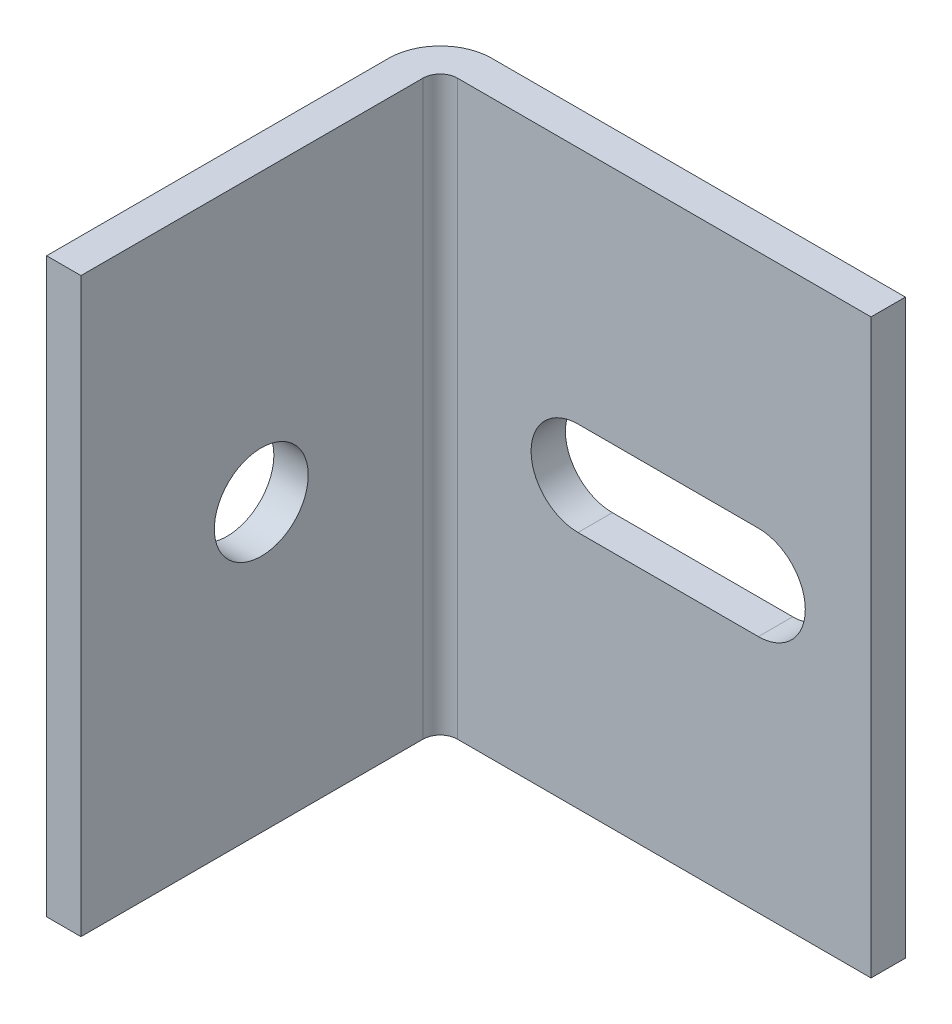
ISO-10303-21;
HEADER;
FILE_DESCRIPTION(('STEP AP214'),'2;1');
FILE_NAME('part.step','',(''),(''),'','','');
FILE_SCHEMA(('AUTOMOTIVE_DESIGN { 1 0 10303 214 1 1 1 1 }'));
ENDSEC;
DATA;
#1=APPLICATION_CONTEXT('core data for automotive mechanical design processes');
#2=APPLICATION_PROTOCOL_DEFINITION('international standard','automotive_design',2000,#1);
#3=PRODUCT_CONTEXT('',#1,'mechanical');
#4=PRODUCT('Part','Part','',(#3));
#5=PRODUCT_RELATED_PRODUCT_CATEGORY('part','',(#4));
#6=PRODUCT_DEFINITION_FORMATION('','',#4);
#7=PRODUCT_DEFINITION_CONTEXT('part definition',#1,'design');
#8=PRODUCT_DEFINITION('design','',#6,#7);
#9=PRODUCT_DEFINITION_SHAPE('','',#8);
#10=(LENGTH_UNIT() NAMED_UNIT(*) SI_UNIT(.MILLI.,.METRE.));
#11=(NAMED_UNIT(*) PLANE_ANGLE_UNIT() SI_UNIT($,.RADIAN.));
#12=(NAMED_UNIT(*) SI_UNIT($,.STERADIAN.) SOLID_ANGLE_UNIT());
#13=UNCERTAINTY_MEASURE_WITH_UNIT(LENGTH_MEASURE(1.E-05),#10,'distance_accuracy_value','');
#14=(GEOMETRIC_REPRESENTATION_CONTEXT(3) GLOBAL_UNCERTAINTY_ASSIGNED_CONTEXT((#13)) GLOBAL_UNIT_ASSIGNED_CONTEXT((#10,
#11,#12)) REPRESENTATION_CONTEXT('',''));
#15=CARTESIAN_POINT('',(0.,0.,0.));
#16=DIRECTION('',(0.,0.,1.));
#17=DIRECTION('',(1.,0.,0.));
#18=AXIS2_PLACEMENT_3D('',#15,#16,#17);
#19=CARTESIAN_POINT('',(2.286,12.7,1.524));
#20=DIRECTION('',(0.,0.,-1.));
#21=DIRECTION('',(-1.,0.,0.));
#22=AXIS2_PLACEMENT_3D('',#19,#20,#21);
#23=PLANE('',#22);
#24=DIRECTION('',(1.,0.,0.));
#25=VECTOR('',#24,1.);
#26=CARTESIAN_POINT('',(2.286,-12.7,1.524));
#27=LINE('',#26,#25);
#28=CARTESIAN_POINT('',(2.286,-12.7,1.524));
#29=VERTEX_POINT('',#28);
#30=CARTESIAN_POINT('',(20.6375,-12.7,1.524));
#31=VERTEX_POINT('',#30);
#32=EDGE_CURVE('E160',#29,#31,#27,.T.);
#33=ORIENTED_EDGE('',*,*,#32,.T.);
#34=DIRECTION('',(0.,-1.,0.));
#35=VECTOR('',#34,1.);
#36=CARTESIAN_POINT('',(20.6375,12.7,1.524));
#37=LINE('',#36,#35);
#38=CARTESIAN_POINT('',(20.6375,12.7,1.524));
#39=VERTEX_POINT('',#38);
#40=EDGE_CURVE('E11',#39,#31,#37,.T.);
#41=ORIENTED_EDGE('',*,*,#40,.F.);
#42=DIRECTION('',(1.,0.,0.));
#43=VECTOR('',#42,1.);
#44=CARTESIAN_POINT('',(2.286,12.7,1.524));
#45=LINE('',#44,#43);
#46=CARTESIAN_POINT('',(2.286,12.7,1.524));
#47=VERTEX_POINT('',#46);
#48=EDGE_CURVE('E163',#47,#39,#45,.T.);
#49=ORIENTED_EDGE('',*,*,#48,.F.);
#50=DIRECTION('',(0.,-1.,0.));
#51=VECTOR('',#50,1.);
#52=CARTESIAN_POINT('',(2.286,12.7,1.524));
#53=LINE('',#52,#51);
#54=EDGE_CURVE('E185',#47,#29,#53,.T.);
#55=ORIENTED_EDGE('',*,*,#54,.T.);
#56=EDGE_LOOP('',(#33,#41,#49,#55));
#57=FACE_BOUND('',#56,.T.);
#58=CARTESIAN_POINT('',(7.63749999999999,0.,1.524));
#59=DIRECTION('',(0.,0.,-1.));
#60=DIRECTION('',(-1.,0.,0.));
#61=AXIS2_PLACEMENT_3D('',#58,#59,#60);
#62=CIRCLE('',#61,2.0828);
#63=CARTESIAN_POINT('',(7.63749999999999,2.0828,1.524));
#64=VERTEX_POINT('',#63);
#65=CARTESIAN_POINT('',(7.63749999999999,-2.0828,1.524));
#66=VERTEX_POINT('',#65);
#67=EDGE_CURVE('E124',#64,#66,#62,.F.);
#68=ORIENTED_EDGE('',*,*,#67,.F.);
#69=DIRECTION('',(-1.,0.,0.));
#70=VECTOR('',#69,1.);
#71=CARTESIAN_POINT('',(2.286,2.0828,1.524));
#72=LINE('',#71,#70);
#73=CARTESIAN_POINT('',(15.6375,2.0828,1.524));
#74=VERTEX_POINT('',#73);
#75=EDGE_CURVE('E127',#74,#64,#72,.T.);
#76=ORIENTED_EDGE('',*,*,#75,.F.);
#77=CARTESIAN_POINT('',(15.6375,0.,1.524));
#78=DIRECTION('',(0.,0.,-1.));
#79=DIRECTION('',(-1.,0.,0.));
#80=AXIS2_PLACEMENT_3D('',#77,#78,#79);
#81=CIRCLE('',#80,2.0828);
#82=CARTESIAN_POINT('',(15.6375,-2.0828,1.524));
#83=VERTEX_POINT('',#82);
#84=EDGE_CURVE('E151',#83,#74,#81,.F.);
#85=ORIENTED_EDGE('',*,*,#84,.F.);
#86=DIRECTION('',(1.,0.,0.));
#87=VECTOR('',#86,1.);
#88=CARTESIAN_POINT('',(2.286,-2.0828,1.524));
#89=LINE('',#88,#87);
#90=EDGE_CURVE('E153',#66,#83,#89,.T.);
#91=ORIENTED_EDGE('',*,*,#90,.F.);
#92=EDGE_LOOP('',(#68,#76,#85,#91));
#93=FACE_BOUND('',#92,.T.);
#94=ADVANCED_FACE('F34',(#57,#93),#23,.F.);
#95=CARTESIAN_POINT('',(2.286,12.7,0.));
#96=DIRECTION('',(0.,0.,-1.));
#97=DIRECTION('',(-1.,0.,0.));
#98=AXIS2_PLACEMENT_3D('',#95,#96,#97);
#99=PLANE('',#98);
#100=DIRECTION('',(1.,0.,0.));
#101=VECTOR('',#100,1.);
#102=CARTESIAN_POINT('',(2.286,-12.7,0.));
#103=LINE('',#102,#101);
#104=CARTESIAN_POINT('',(2.286,-12.7,0.));
#105=VERTEX_POINT('',#104);
#106=CARTESIAN_POINT('',(20.6375,-12.7,0.));
#107=VERTEX_POINT('',#106);
#108=EDGE_CURVE('E191',#105,#107,#103,.T.);
#109=ORIENTED_EDGE('',*,*,#108,.F.);
#110=DIRECTION('',(0.,-1.,0.));
#111=VECTOR('',#110,1.);
#112=CARTESIAN_POINT('',(2.286,12.7,0.));
#113=LINE('',#112,#111);
#114=CARTESIAN_POINT('',(2.286,12.7,0.));
#115=VERTEX_POINT('',#114);
#116=EDGE_CURVE('E217',#115,#105,#113,.T.);
#117=ORIENTED_EDGE('',*,*,#116,.F.);
#118=DIRECTION('',(1.,0.,0.));
#119=VECTOR('',#118,1.);
#120=CARTESIAN_POINT('',(2.286,12.7,0.));
#121=LINE('',#120,#119);
#122=CARTESIAN_POINT('',(20.6375,12.7,0.));
#123=VERTEX_POINT('',#122);
#124=EDGE_CURVE('E169',#115,#123,#121,.T.);
#125=ORIENTED_EDGE('',*,*,#124,.T.);
#126=DIRECTION('',(0.,-1.,0.));
#127=VECTOR('',#126,1.);
#128=CARTESIAN_POINT('',(20.6375,12.7,0.));
#129=LINE('',#128,#127);
#130=EDGE_CURVE('E41',#123,#107,#129,.T.);
#131=ORIENTED_EDGE('',*,*,#130,.T.);
#132=EDGE_LOOP('',(#109,#117,#125,#131));
#133=FACE_BOUND('',#132,.T.);
#134=DIRECTION('',(-1.,0.,0.));
#135=VECTOR('',#134,1.);
#136=CARTESIAN_POINT('',(7.63749999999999,2.0828,0.));
#137=LINE('',#136,#135);
#138=CARTESIAN_POINT('',(15.6375,2.0828,0.));
#139=VERTEX_POINT('',#138);
#140=CARTESIAN_POINT('',(7.63749999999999,2.0828,0.));
#141=VERTEX_POINT('',#140);
#142=EDGE_CURVE('E141',#139,#141,#137,.T.);
#143=ORIENTED_EDGE('',*,*,#142,.T.);
#144=CARTESIAN_POINT('',(7.63749999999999,0.,0.));
#145=DIRECTION('',(0.,0.,1.));
#146=DIRECTION('',(1.,0.,0.));
#147=AXIS2_PLACEMENT_3D('',#144,#145,#146);
#148=CIRCLE('',#147,2.0828);
#149=CARTESIAN_POINT('',(7.63749999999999,-2.0828,0.));
#150=VERTEX_POINT('',#149);
#151=EDGE_CURVE('E56',#141,#150,#148,.T.);
#152=ORIENTED_EDGE('',*,*,#151,.T.);
#153=DIRECTION('',(1.,0.,0.));
#154=VECTOR('',#153,1.);
#155=CARTESIAN_POINT('',(7.63749999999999,-2.0828,0.));
#156=LINE('',#155,#154);
#157=CARTESIAN_POINT('',(15.6375,-2.0828,0.));
#158=VERTEX_POINT('',#157);
#159=EDGE_CURVE('E131',#150,#158,#156,.T.);
#160=ORIENTED_EDGE('',*,*,#159,.T.);
#161=CARTESIAN_POINT('',(15.6375,0.,0.));
#162=DIRECTION('',(0.,0.,1.));
#163=DIRECTION('',(1.,0.,0.));
#164=AXIS2_PLACEMENT_3D('',#161,#162,#163);
#165=CIRCLE('',#164,2.0828);
#166=EDGE_CURVE('E137',#158,#139,#165,.T.);
#167=ORIENTED_EDGE('',*,*,#166,.T.);
#168=EDGE_LOOP('',(#143,#152,#160,#167));
#169=FACE_BOUND('',#168,.T.);
#170=ADVANCED_FACE('F140',(#133,#169),#99,.T.);
#171=CARTESIAN_POINT('',(20.6375,12.7,0.));
#172=DIRECTION('',(1.,0.,0.));
#173=DIRECTION('',(0.,0.,-1.));
#174=AXIS2_PLACEMENT_3D('',#171,#172,#173);
#175=PLANE('',#174);
#176=DIRECTION('',(0.,0.,1.));
#177=VECTOR('',#176,1.);
#178=CARTESIAN_POINT('',(20.6375,-12.7,0.));
#179=LINE('',#178,#177);
#180=EDGE_CURVE('E188',#107,#31,#179,.T.);
#181=ORIENTED_EDGE('',*,*,#180,.F.);
#182=ORIENTED_EDGE('',*,*,#130,.F.);
#183=DIRECTION('',(0.,0.,1.));
#184=VECTOR('',#183,1.);
#185=CARTESIAN_POINT('',(20.6375,12.7,0.));
#186=LINE('',#185,#184);
#187=EDGE_CURVE('E165',#123,#39,#186,.T.);
#188=ORIENTED_EDGE('',*,*,#187,.T.);
#189=ORIENTED_EDGE('',*,*,#40,.T.);
#190=EDGE_LOOP('',(#181,#182,#188,#189));
#191=FACE_BOUND('',#190,.T.);
#192=ADVANCED_FACE('F224',(#191),#175,.T.);
#193=CARTESIAN_POINT('',(2.286,12.7,2.286));
#194=DIRECTION('',(0.,-1.,0.));
#195=DIRECTION('',(0.,0.,-1.));
#196=AXIS2_PLACEMENT_3D('',#193,#194,#195);
#197=CYLINDRICAL_SURFACE('',#196,2.286);
#198=CARTESIAN_POINT('',(2.286,-12.7,2.286));
#199=DIRECTION('',(0.,-1.,0.));
#200=DIRECTION('',(0.,0.,1.));
#201=AXIS2_PLACEMENT_3D('',#198,#199,#200);
#202=CIRCLE('',#201,2.286);
#203=CARTESIAN_POINT('',(0.,-12.7,2.286));
#204=VERTEX_POINT('',#203);
#205=EDGE_CURVE('E194',#204,#105,#202,.T.);
#206=ORIENTED_EDGE('',*,*,#205,.F.);
#207=DIRECTION('',(0.,-1.,0.));
#208=VECTOR('',#207,1.);
#209=CARTESIAN_POINT('',(0.,12.7,2.286));
#210=LINE('',#209,#208);
#211=CARTESIAN_POINT('',(0.,12.7,2.286));
#212=VERTEX_POINT('',#211);
#213=EDGE_CURVE('E215',#212,#204,#210,.T.);
#214=ORIENTED_EDGE('',*,*,#213,.F.);
#215=CARTESIAN_POINT('',(2.286,12.7,2.286));
#216=DIRECTION('',(0.,-1.,0.));
#217=DIRECTION('',(0.,0.,1.));
#218=AXIS2_PLACEMENT_3D('',#215,#216,#217);
#219=CIRCLE('',#218,2.286);
#220=EDGE_CURVE('E172',#212,#115,#219,.T.);
#221=ORIENTED_EDGE('',*,*,#220,.T.);
#222=ORIENTED_EDGE('',*,*,#116,.T.);
#223=EDGE_LOOP('',(#206,#214,#221,#222));
#224=FACE_BOUND('',#223,.T.);
#225=ADVANCED_FACE('F232',(#224),#197,.T.);
#226=CARTESIAN_POINT('',(0.,12.7,17.4625));
#227=DIRECTION('',(-1.,0.,0.));
#228=DIRECTION('',(0.,0.,1.));
#229=AXIS2_PLACEMENT_3D('',#226,#227,#228);
#230=PLANE('',#229);
#231=CARTESIAN_POINT('',(0.,0.,9.4625));
#232=DIRECTION('',(1.,0.,0.));
#233=DIRECTION('',(0.,0.,-1.));
#234=AXIS2_PLACEMENT_3D('',#231,#232,#233);
#235=CIRCLE('',#234,2.0828);
#236=CARTESIAN_POINT('',(0.,0.,7.3797));
#237=VERTEX_POINT('',#236);
#238=EDGE_CURVE('E157',#237,#237,#235,.T.);
#239=ORIENTED_EDGE('',*,*,#238,.T.);
#240=EDGE_LOOP('',(#239));
#241=FACE_BOUND('',#240,.T.);
#242=DIRECTION('',(0.,0.,-1.));
#243=VECTOR('',#242,1.);
#244=CARTESIAN_POINT('',(0.,-12.7,17.4625));
#245=LINE('',#244,#243);
#246=CARTESIAN_POINT('',(0.,-12.7,17.4625));
#247=VERTEX_POINT('',#246);
#248=EDGE_CURVE('E197',#247,#204,#245,.T.);
#249=ORIENTED_EDGE('',*,*,#248,.F.);
#250=DIRECTION('',(0.,-1.,0.));
#251=VECTOR('',#250,1.);
#252=CARTESIAN_POINT('',(0.,12.7,17.4625));
#253=LINE('',#252,#251);
#254=CARTESIAN_POINT('',(0.,12.7,17.4625));
#255=VERTEX_POINT('',#254);
#256=EDGE_CURVE('E213',#255,#247,#253,.T.);
#257=ORIENTED_EDGE('',*,*,#256,.F.);
#258=DIRECTION('',(0.,0.,-1.));
#259=VECTOR('',#258,1.);
#260=CARTESIAN_POINT('',(0.,12.7,17.4625));
#261=LINE('',#260,#259);
#262=EDGE_CURVE('E175',#255,#212,#261,.T.);
#263=ORIENTED_EDGE('',*,*,#262,.T.);
#264=ORIENTED_EDGE('',*,*,#213,.T.);
#265=EDGE_LOOP('',(#249,#257,#263,#264));
#266=FACE_BOUND('',#265,.T.);
#267=ADVANCED_FACE('F255',(#241,#266),#230,.T.);
#268=CARTESIAN_POINT('',(1.524,12.7,17.4625));
#269=DIRECTION('',(0.,0.,1.));
#270=DIRECTION('',(1.,0.,0.));
#271=AXIS2_PLACEMENT_3D('',#268,#269,#270);
#272=PLANE('',#271);
#273=DIRECTION('',(-1.,0.,0.));
#274=VECTOR('',#273,1.);
#275=CARTESIAN_POINT('',(1.524,-12.7,17.4625));
#276=LINE('',#275,#274);
#277=CARTESIAN_POINT('',(1.524,-12.7,17.4625));
#278=VERTEX_POINT('',#277);
#279=EDGE_CURVE('E200',#278,#247,#276,.T.);
#280=ORIENTED_EDGE('',*,*,#279,.F.);
#281=DIRECTION('',(0.,-1.,0.));
#282=VECTOR('',#281,1.);
#283=CARTESIAN_POINT('',(1.524,12.7,17.4625));
#284=LINE('',#283,#282);
#285=CARTESIAN_POINT('',(1.524,12.7,17.4625));
#286=VERTEX_POINT('',#285);
#287=EDGE_CURVE('E211',#286,#278,#284,.T.);
#288=ORIENTED_EDGE('',*,*,#287,.F.);
#289=DIRECTION('',(-1.,0.,0.));
#290=VECTOR('',#289,1.);
#291=CARTESIAN_POINT('',(1.524,12.7,17.4625));
#292=LINE('',#291,#290);
#293=EDGE_CURVE('E178',#286,#255,#292,.T.);
#294=ORIENTED_EDGE('',*,*,#293,.T.);
#295=ORIENTED_EDGE('',*,*,#256,.T.);
#296=EDGE_LOOP('',(#280,#288,#294,#295));
#297=FACE_BOUND('',#296,.T.);
#298=ADVANCED_FACE('F253',(#297),#272,.T.);
#299=CARTESIAN_POINT('',(1.524,12.7,17.4625));
#300=DIRECTION('',(-1.,0.,0.));
#301=DIRECTION('',(0.,0.,1.));
#302=AXIS2_PLACEMENT_3D('',#299,#300,#301);
#303=PLANE('',#302);
#304=CARTESIAN_POINT('',(1.524,0.,9.4625));
#305=DIRECTION('',(1.,0.,0.));
#306=DIRECTION('',(0.,0.,-1.));
#307=AXIS2_PLACEMENT_3D('',#304,#305,#306);
#308=CIRCLE('',#307,2.0828);
#309=CARTESIAN_POINT('',(1.524,0.,7.3797));
#310=VERTEX_POINT('',#309);
#311=EDGE_CURVE('E156',#310,#310,#308,.T.);
#312=ORIENTED_EDGE('',*,*,#311,.F.);
#313=EDGE_LOOP('',(#312));
#314=FACE_BOUND('',#313,.T.);
#315=DIRECTION('',(0.,0.,-1.));
#316=VECTOR('',#315,1.);
#317=CARTESIAN_POINT('',(1.524,-12.7,17.4625));
#318=LINE('',#317,#316);
#319=CARTESIAN_POINT('',(1.524,-12.7,2.286));
#320=VERTEX_POINT('',#319);
#321=EDGE_CURVE('E203',#278,#320,#318,.T.);
#322=ORIENTED_EDGE('',*,*,#321,.T.);
#323=DIRECTION('',(0.,-1.,0.));
#324=VECTOR('',#323,1.);
#325=CARTESIAN_POINT('',(1.524,12.7,2.286));
#326=LINE('',#325,#324);
#327=CARTESIAN_POINT('',(1.524,12.7,2.286));
#328=VERTEX_POINT('',#327);
#329=EDGE_CURVE('E208',#328,#320,#326,.T.);
#330=ORIENTED_EDGE('',*,*,#329,.F.);
#331=DIRECTION('',(0.,0.,-1.));
#332=VECTOR('',#331,1.);
#333=CARTESIAN_POINT('',(1.524,12.7,17.4625));
#334=LINE('',#333,#332);
#335=EDGE_CURVE('E181',#286,#328,#334,.T.);
#336=ORIENTED_EDGE('',*,*,#335,.F.);
#337=ORIENTED_EDGE('',*,*,#287,.T.);
#338=EDGE_LOOP('',(#322,#330,#336,#337));
#339=FACE_BOUND('',#338,.T.);
#340=ADVANCED_FACE('F250',(#314,#339),#303,.F.);
#341=CARTESIAN_POINT('',(2.286,12.7,2.286));
#342=DIRECTION('',(0.,-1.,0.));
#343=DIRECTION('',(0.,0.,-1.));
#344=AXIS2_PLACEMENT_3D('',#341,#342,#343);
#345=CYLINDRICAL_SURFACE('',#344,0.762);
#346=CARTESIAN_POINT('',(2.286,-12.7,2.286));
#347=DIRECTION('',(0.,1.,0.));
#348=DIRECTION('',(1.,0.,0.));
#349=AXIS2_PLACEMENT_3D('',#346,#347,#348);
#350=CIRCLE('',#349,0.762);
#351=EDGE_CURVE('E166',#320,#29,#350,.F.);
#352=ORIENTED_EDGE('',*,*,#351,.T.);
#353=ORIENTED_EDGE('',*,*,#54,.F.);
#354=CARTESIAN_POINT('',(2.286,12.7,2.286));
#355=DIRECTION('',(0.,1.,0.));
#356=DIRECTION('',(1.,0.,0.));
#357=AXIS2_PLACEMENT_3D('',#354,#355,#356);
#358=CIRCLE('',#357,0.762);
#359=EDGE_CURVE('E183',#328,#47,#358,.F.);
#360=ORIENTED_EDGE('',*,*,#359,.F.);
#361=ORIENTED_EDGE('',*,*,#329,.T.);
#362=EDGE_LOOP('',(#352,#353,#360,#361));
#363=FACE_BOUND('',#362,.T.);
#364=ADVANCED_FACE('F246',(#363),#345,.F.);
#365=CARTESIAN_POINT('',(2.286,12.7,2.286));
#366=DIRECTION('',(0.,-1.,0.));
#367=DIRECTION('',(-1.,0.,0.));
#368=AXIS2_PLACEMENT_3D('',#365,#366,#367);
#369=PLANE('',#368);
#370=ORIENTED_EDGE('',*,*,#48,.T.);
#371=ORIENTED_EDGE('',*,*,#187,.F.);
#372=ORIENTED_EDGE('',*,*,#124,.F.);
#373=ORIENTED_EDGE('',*,*,#220,.F.);
#374=ORIENTED_EDGE('',*,*,#262,.F.);
#375=ORIENTED_EDGE('',*,*,#293,.F.);
#376=ORIENTED_EDGE('',*,*,#335,.T.);
#377=ORIENTED_EDGE('',*,*,#359,.T.);
#378=EDGE_LOOP('',(#370,#371,#372,#373,#374,#375,#376,#377));
#379=FACE_BOUND('',#378,.T.);
#380=ADVANCED_FACE('F235',(#379),#369,.F.);
#381=CARTESIAN_POINT('',(2.286,-12.7,2.286));
#382=DIRECTION('',(0.,-1.,0.));
#383=DIRECTION('',(-1.,0.,0.));
#384=AXIS2_PLACEMENT_3D('',#381,#382,#383);
#385=PLANE('',#384);
#386=ORIENTED_EDGE('',*,*,#32,.F.);
#387=ORIENTED_EDGE('',*,*,#351,.F.);
#388=ORIENTED_EDGE('',*,*,#321,.F.);
#389=ORIENTED_EDGE('',*,*,#279,.T.);
#390=ORIENTED_EDGE('',*,*,#248,.T.);
#391=ORIENTED_EDGE('',*,*,#205,.T.);
#392=ORIENTED_EDGE('',*,*,#108,.T.);
#393=ORIENTED_EDGE('',*,*,#180,.T.);
#394=EDGE_LOOP('',(#386,#387,#388,#389,#390,#391,#392,#393));
#395=FACE_BOUND('',#394,.T.);
#396=ADVANCED_FACE('F228',(#395),#385,.T.);
#397=CARTESIAN_POINT('',(0.,0.,9.4625));
#398=DIRECTION('',(1.,0.,0.));
#399=DIRECTION('',(0.,0.,-1.));
#400=AXIS2_PLACEMENT_3D('',#397,#398,#399);
#401=CYLINDRICAL_SURFACE('',#400,2.0828);
#402=ORIENTED_EDGE('',*,*,#238,.F.);
#403=EDGE_LOOP('',(#402));
#404=FACE_BOUND('',#403,.T.);
#405=ORIENTED_EDGE('',*,*,#311,.T.);
#406=EDGE_LOOP('',(#405));
#407=FACE_BOUND('',#406,.T.);
#408=ADVANCED_FACE('F312',(#404,#407),#401,.F.);
#409=CARTESIAN_POINT('',(7.63749999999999,0.,17.4625));
#410=DIRECTION('',(0.,0.,-1.));
#411=DIRECTION('',(-1.,0.,0.));
#412=AXIS2_PLACEMENT_3D('',#409,#410,#411);
#413=CYLINDRICAL_SURFACE('',#412,2.0828);
#414=ORIENTED_EDGE('',*,*,#67,.T.);
#415=DIRECTION('',(0.,0.,-1.));
#416=VECTOR('',#415,1.);
#417=CARTESIAN_POINT('',(7.63749999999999,-2.0828,17.4625));
#418=LINE('',#417,#416);
#419=EDGE_CURVE('E120',#66,#150,#418,.T.);
#420=ORIENTED_EDGE('',*,*,#419,.T.);
#421=ORIENTED_EDGE('',*,*,#151,.F.);
#422=DIRECTION('',(0.,0.,-1.));
#423=VECTOR('',#422,1.);
#424=CARTESIAN_POINT('',(7.63749999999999,2.0828,17.4625));
#425=LINE('',#424,#423);
#426=EDGE_CURVE('E146',#64,#141,#425,.T.);
#427=ORIENTED_EDGE('',*,*,#426,.F.);
#428=EDGE_LOOP('',(#414,#420,#421,#427));
#429=FACE_BOUND('',#428,.T.);
#430=ADVANCED_FACE('F122',(#429),#413,.F.);
#431=CARTESIAN_POINT('',(7.63749999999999,-2.0828,17.4625));
#432=DIRECTION('',(0.,1.,0.));
#433=DIRECTION('',(0.,0.,1.));
#434=AXIS2_PLACEMENT_3D('',#431,#432,#433);
#435=PLANE('',#434);
#436=ORIENTED_EDGE('',*,*,#90,.T.);
#437=DIRECTION('',(0.,0.,-1.));
#438=VECTOR('',#437,1.);
#439=CARTESIAN_POINT('',(15.6375,-2.0828,17.4625));
#440=LINE('',#439,#438);
#441=EDGE_CURVE('E128',#83,#158,#440,.T.);
#442=ORIENTED_EDGE('',*,*,#441,.T.);
#443=ORIENTED_EDGE('',*,*,#159,.F.);
#444=ORIENTED_EDGE('',*,*,#419,.F.);
#445=EDGE_LOOP('',(#436,#442,#443,#444));
#446=FACE_BOUND('',#445,.T.);
#447=ADVANCED_FACE('F132',(#446),#435,.T.);
#448=CARTESIAN_POINT('',(15.6375,0.,17.4625));
#449=DIRECTION('',(0.,0.,-1.));
#450=DIRECTION('',(-1.,0.,0.));
#451=AXIS2_PLACEMENT_3D('',#448,#449,#450);
#452=CYLINDRICAL_SURFACE('',#451,2.0828);
#453=ORIENTED_EDGE('',*,*,#84,.T.);
#454=DIRECTION('',(0.,0.,-1.));
#455=VECTOR('',#454,1.);
#456=CARTESIAN_POINT('',(15.6375,2.0828,17.4625));
#457=LINE('',#456,#455);
#458=EDGE_CURVE('E48',#74,#139,#457,.T.);
#459=ORIENTED_EDGE('',*,*,#458,.T.);
#460=ORIENTED_EDGE('',*,*,#166,.F.);
#461=ORIENTED_EDGE('',*,*,#441,.F.);
#462=EDGE_LOOP('',(#453,#459,#460,#461));
#463=FACE_BOUND('',#462,.T.);
#464=ADVANCED_FACE('F357',(#463),#452,.F.);
#465=CARTESIAN_POINT('',(7.63749999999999,2.0828,17.4625));
#466=DIRECTION('',(0.,-1.,0.));
#467=DIRECTION('',(0.,0.,-1.));
#468=AXIS2_PLACEMENT_3D('',#465,#466,#467);
#469=PLANE('',#468);
#470=ORIENTED_EDGE('',*,*,#75,.T.);
#471=ORIENTED_EDGE('',*,*,#426,.T.);
#472=ORIENTED_EDGE('',*,*,#142,.F.);
#473=ORIENTED_EDGE('',*,*,#458,.F.);
#474=EDGE_LOOP('',(#470,#471,#472,#473));
#475=FACE_BOUND('',#474,.T.);
#476=ADVANCED_FACE('F366',(#475),#469,.T.);
#477=CLOSED_SHELL('',(#94,#170,#192,#225,#267,#298,#340,#364,#380,#396,#408,#430,#447,#464,#476));
#478=MANIFOLD_SOLID_BREP('B2',#477);
#479=ADVANCED_BREP_SHAPE_REPRESENTATION('',(#18,#478),#14);
#480=SHAPE_DEFINITION_REPRESENTATION(#9,#479);
ENDSEC;
END-ISO-10303-21;
